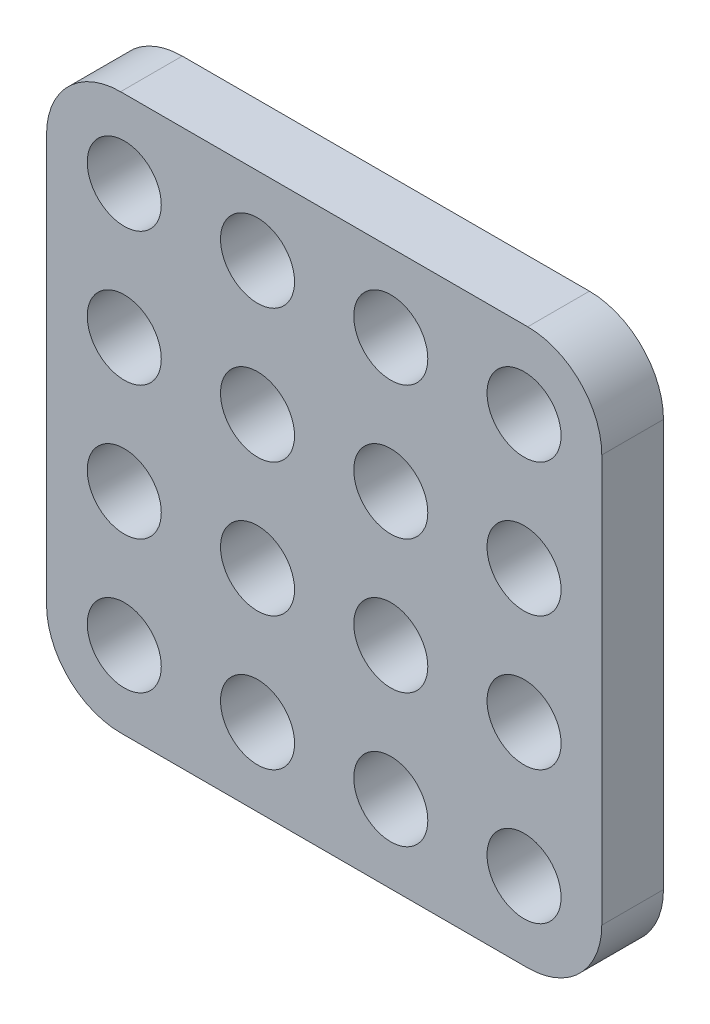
ISO-10303-21;
HEADER;
FILE_DESCRIPTION(('STEP AP214'),'2;1');
FILE_NAME('part.step','',(''),(''),'','','');
FILE_SCHEMA(('AUTOMOTIVE_DESIGN { 1 0 10303 214 1 1 1 1 }'));
ENDSEC;
DATA;
#1=APPLICATION_CONTEXT('core data for automotive mechanical design processes');
#2=APPLICATION_PROTOCOL_DEFINITION('international standard','automotive_design',2000,#1);
#3=PRODUCT_CONTEXT('',#1,'mechanical');
#4=PRODUCT('Part','Part','',(#3));
#5=PRODUCT_RELATED_PRODUCT_CATEGORY('part','',(#4));
#6=PRODUCT_DEFINITION_FORMATION('','',#4);
#7=PRODUCT_DEFINITION_CONTEXT('part definition',#1,'design');
#8=PRODUCT_DEFINITION('design','',#6,#7);
#9=PRODUCT_DEFINITION_SHAPE('','',#8);
#10=(LENGTH_UNIT() NAMED_UNIT(*) SI_UNIT(.MILLI.,.METRE.));
#11=(NAMED_UNIT(*) PLANE_ANGLE_UNIT() SI_UNIT($,.RADIAN.));
#12=(NAMED_UNIT(*) SI_UNIT($,.STERADIAN.) SOLID_ANGLE_UNIT());
#13=UNCERTAINTY_MEASURE_WITH_UNIT(LENGTH_MEASURE(1.E-05),#10,'distance_accuracy_value','');
#14=(GEOMETRIC_REPRESENTATION_CONTEXT(3) GLOBAL_UNCERTAINTY_ASSIGNED_CONTEXT((#13)) GLOBAL_UNIT_ASSIGNED_CONTEXT((#10,
#11,#12)) REPRESENTATION_CONTEXT('',''));
#15=CARTESIAN_POINT('',(0.,0.,0.));
#16=DIRECTION('',(0.,0.,1.));
#17=DIRECTION('',(1.,0.,0.));
#18=AXIS2_PLACEMENT_3D('',#15,#16,#17);
#19=CARTESIAN_POINT('',(93.2050056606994,230.510748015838,10.));
#20=DIRECTION('',(0.,0.,1.));
#21=DIRECTION('',(1.,0.,0.));
#22=AXIS2_PLACEMENT_3D('',#19,#20,#21);
#23=PLANE('',#22);
#24=CARTESIAN_POINT('',(49.4050056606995,186.710748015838,10.));
#25=DIRECTION('',(0.,0.,1.));
#26=DIRECTION('',(1.,0.,0.));
#27=AXIS2_PLACEMENT_3D('',#24,#25,#26);
#28=CIRCLE('',#27,5.99999999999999);
#29=CARTESIAN_POINT('',(55.4050056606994,186.710748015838,10.));
#30=VERTEX_POINT('',#29);
#31=EDGE_CURVE('E260',#30,#30,#28,.T.);
#32=ORIENTED_EDGE('',*,*,#31,.F.);
#33=EDGE_LOOP('',(#32));
#34=FACE_BOUND('',#33,.T.);
#35=CARTESIAN_POINT('',(49.4050056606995,208.310748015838,10.));
#36=DIRECTION('',(0.,0.,1.));
#37=DIRECTION('',(1.,0.,0.));
#38=AXIS2_PLACEMENT_3D('',#35,#36,#37);
#39=CIRCLE('',#38,5.99999999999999);
#40=CARTESIAN_POINT('',(55.4050056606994,208.310748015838,10.));
#41=VERTEX_POINT('',#40);
#42=EDGE_CURVE('E248',#41,#41,#39,.T.);
#43=ORIENTED_EDGE('',*,*,#42,.F.);
#44=EDGE_LOOP('',(#43));
#45=FACE_BOUND('',#44,.T.);
#46=CARTESIAN_POINT('',(49.4050056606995,165.110748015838,10.));
#47=DIRECTION('',(0.,0.,1.));
#48=DIRECTION('',(1.,0.,0.));
#49=AXIS2_PLACEMENT_3D('',#46,#47,#48);
#50=CIRCLE('',#49,5.99999999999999);
#51=CARTESIAN_POINT('',(55.4050056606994,165.110748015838,10.));
#52=VERTEX_POINT('',#51);
#53=EDGE_CURVE('E236',#52,#52,#50,.T.);
#54=ORIENTED_EDGE('',*,*,#53,.F.);
#55=EDGE_LOOP('',(#54));
#56=FACE_BOUND('',#55,.T.);
#57=CARTESIAN_POINT('',(71.0050056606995,165.110748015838,10.));
#58=DIRECTION('',(0.,0.,1.));
#59=DIRECTION('',(1.,0.,0.));
#60=AXIS2_PLACEMENT_3D('',#57,#58,#59);
#61=CIRCLE('',#60,6.00000000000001);
#62=CARTESIAN_POINT('',(77.0050056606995,165.110748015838,10.));
#63=VERTEX_POINT('',#62);
#64=EDGE_CURVE('E224',#63,#63,#61,.T.);
#65=ORIENTED_EDGE('',*,*,#64,.F.);
#66=EDGE_LOOP('',(#65));
#67=FACE_BOUND('',#66,.T.);
#68=CARTESIAN_POINT('',(27.8050056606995,229.910748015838,10.));
#69=DIRECTION('',(0.,0.,1.));
#70=DIRECTION('',(1.,0.,0.));
#71=AXIS2_PLACEMENT_3D('',#68,#69,#70);
#72=CIRCLE('',#71,6.);
#73=CARTESIAN_POINT('',(33.8050056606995,229.910748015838,10.));
#74=VERTEX_POINT('',#73);
#75=EDGE_CURVE('E212',#74,#74,#72,.T.);
#76=ORIENTED_EDGE('',*,*,#75,.F.);
#77=EDGE_LOOP('',(#76));
#78=FACE_BOUND('',#77,.T.);
#79=CARTESIAN_POINT('',(27.8050056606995,165.110748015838,10.));
#80=DIRECTION('',(0.,0.,1.));
#81=DIRECTION('',(1.,0.,0.));
#82=AXIS2_PLACEMENT_3D('',#79,#80,#81);
#83=CIRCLE('',#82,6.);
#84=CARTESIAN_POINT('',(33.8050056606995,165.110748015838,10.));
#85=VERTEX_POINT('',#84);
#86=EDGE_CURVE('E200',#85,#85,#83,.T.);
#87=ORIENTED_EDGE('',*,*,#86,.F.);
#88=EDGE_LOOP('',(#87));
#89=FACE_BOUND('',#88,.T.);
#90=CARTESIAN_POINT('',(92.6050056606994,208.310748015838,10.));
#91=DIRECTION('',(0.,0.,1.));
#92=DIRECTION('',(1.,0.,0.));
#93=AXIS2_PLACEMENT_3D('',#90,#91,#92);
#94=CIRCLE('',#93,6.00000000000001);
#95=CARTESIAN_POINT('',(98.6050056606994,208.310748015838,10.));
#96=VERTEX_POINT('',#95);
#97=EDGE_CURVE('E188',#96,#96,#94,.T.);
#98=ORIENTED_EDGE('',*,*,#97,.F.);
#99=EDGE_LOOP('',(#98));
#100=FACE_BOUND('',#99,.T.);
#101=CARTESIAN_POINT('',(71.0050056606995,208.310748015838,10.));
#102=DIRECTION('',(0.,0.,1.));
#103=DIRECTION('',(1.,0.,0.));
#104=AXIS2_PLACEMENT_3D('',#101,#102,#103);
#105=CIRCLE('',#104,6.00000000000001);
#106=CARTESIAN_POINT('',(77.0050056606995,208.310748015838,10.));
#107=VERTEX_POINT('',#106);
#108=EDGE_CURVE('E134',#107,#107,#105,.T.);
#109=ORIENTED_EDGE('',*,*,#108,.F.);
#110=EDGE_LOOP('',(#109));
#111=FACE_BOUND('',#110,.T.);
#112=CARTESIAN_POINT('',(93.2050056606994,230.510748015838,10.));
#113=DIRECTION('',(0.,0.,1.));
#114=DIRECTION('',(1.,0.,0.));
#115=AXIS2_PLACEMENT_3D('',#112,#113,#114);
#116=CIRCLE('',#115,12.);
#117=CARTESIAN_POINT('',(105.205005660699,230.510748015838,10.));
#118=VERTEX_POINT('',#117);
#119=CARTESIAN_POINT('',(93.2050056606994,242.510748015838,10.));
#120=VERTEX_POINT('',#119);
#121=EDGE_CURVE('E145',#118,#120,#116,.T.);
#122=ORIENTED_EDGE('',*,*,#121,.T.);
#123=DIRECTION('',(-1.,0.,0.));
#124=VECTOR('',#123,1.);
#125=CARTESIAN_POINT('',(27.2050056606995,242.510748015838,10.));
#126=LINE('',#125,#124);
#127=CARTESIAN_POINT('',(27.2050056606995,242.510748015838,10.));
#128=VERTEX_POINT('',#127);
#129=EDGE_CURVE('E93',#120,#128,#126,.T.);
#130=ORIENTED_EDGE('',*,*,#129,.T.);
#131=CARTESIAN_POINT('',(27.2050056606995,230.510748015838,10.));
#132=DIRECTION('',(0.,0.,1.));
#133=DIRECTION('',(1.,0.,0.));
#134=AXIS2_PLACEMENT_3D('',#131,#132,#133);
#135=CIRCLE('',#134,12.);
#136=CARTESIAN_POINT('',(15.2050056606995,230.510748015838,10.));
#137=VERTEX_POINT('',#136);
#138=EDGE_CURVE('E160',#128,#137,#135,.T.);
#139=ORIENTED_EDGE('',*,*,#138,.T.);
#140=DIRECTION('',(0.,-1.,0.));
#141=VECTOR('',#140,1.);
#142=CARTESIAN_POINT('',(15.2050056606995,230.510748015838,10.));
#143=LINE('',#142,#141);
#144=CARTESIAN_POINT('',(15.2050056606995,164.510748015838,10.));
#145=VERTEX_POINT('',#144);
#146=EDGE_CURVE('E173',#137,#145,#143,.T.);
#147=ORIENTED_EDGE('',*,*,#146,.T.);
#148=CARTESIAN_POINT('',(27.2050056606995,164.510748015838,10.));
#149=DIRECTION('',(0.,0.,1.));
#150=DIRECTION('',(1.,0.,0.));
#151=AXIS2_PLACEMENT_3D('',#148,#149,#150);
#152=CIRCLE('',#151,12.);
#153=CARTESIAN_POINT('',(27.2050056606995,152.510748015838,10.));
#154=VERTEX_POINT('',#153);
#155=EDGE_CURVE('E112',#145,#154,#152,.T.);
#156=ORIENTED_EDGE('',*,*,#155,.T.);
#157=DIRECTION('',(1.,0.,0.));
#158=VECTOR('',#157,1.);
#159=CARTESIAN_POINT('',(27.2050056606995,152.510748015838,10.));
#160=LINE('',#159,#158);
#161=CARTESIAN_POINT('',(93.2050056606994,152.510748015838,10.));
#162=VERTEX_POINT('',#161);
#163=EDGE_CURVE('E106',#154,#162,#160,.T.);
#164=ORIENTED_EDGE('',*,*,#163,.T.);
#165=CARTESIAN_POINT('',(93.2050056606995,164.510748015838,10.));
#166=DIRECTION('',(0.,0.,1.));
#167=DIRECTION('',(1.,0.,0.));
#168=AXIS2_PLACEMENT_3D('',#165,#166,#167);
#169=CIRCLE('',#168,12.);
#170=CARTESIAN_POINT('',(105.205005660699,164.510748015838,10.));
#171=VERTEX_POINT('',#170);
#172=EDGE_CURVE('E110',#162,#171,#169,.T.);
#173=ORIENTED_EDGE('',*,*,#172,.T.);
#174=DIRECTION('',(0.,1.,0.));
#175=VECTOR('',#174,1.);
#176=CARTESIAN_POINT('',(105.205005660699,230.510748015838,10.));
#177=LINE('',#176,#175);
#178=EDGE_CURVE('E50',#171,#118,#177,.T.);
#179=ORIENTED_EDGE('',*,*,#178,.T.);
#180=EDGE_LOOP('',(#122,#130,#139,#147,#156,#164,#173,#179));
#181=FACE_BOUND('',#180,.T.);
#182=CARTESIAN_POINT('',(92.6050056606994,229.910748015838,10.));
#183=DIRECTION('',(0.,0.,1.));
#184=DIRECTION('',(1.,0.,0.));
#185=AXIS2_PLACEMENT_3D('',#182,#183,#184);
#186=CIRCLE('',#185,6.00000000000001);
#187=CARTESIAN_POINT('',(98.6050056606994,229.910748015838,10.));
#188=VERTEX_POINT('',#187);
#189=EDGE_CURVE('E182',#188,#188,#186,.T.);
#190=ORIENTED_EDGE('',*,*,#189,.F.);
#191=EDGE_LOOP('',(#190));
#192=FACE_BOUND('',#191,.T.);
#193=CARTESIAN_POINT('',(71.0050056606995,186.710748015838,10.));
#194=DIRECTION('',(0.,0.,1.));
#195=DIRECTION('',(1.,0.,0.));
#196=AXIS2_PLACEMENT_3D('',#193,#194,#195);
#197=CIRCLE('',#196,6.00000000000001);
#198=CARTESIAN_POINT('',(77.0050056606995,186.710748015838,10.));
#199=VERTEX_POINT('',#198);
#200=EDGE_CURVE('E194',#199,#199,#197,.T.);
#201=ORIENTED_EDGE('',*,*,#200,.F.);
#202=EDGE_LOOP('',(#201));
#203=FACE_BOUND('',#202,.T.);
#204=CARTESIAN_POINT('',(92.6050056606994,186.710748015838,10.));
#205=DIRECTION('',(0.,0.,1.));
#206=DIRECTION('',(1.,0.,0.));
#207=AXIS2_PLACEMENT_3D('',#204,#205,#206);
#208=CIRCLE('',#207,6.00000000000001);
#209=CARTESIAN_POINT('',(98.6050056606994,186.710748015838,10.));
#210=VERTEX_POINT('',#209);
#211=EDGE_CURVE('E206',#210,#210,#208,.T.);
#212=ORIENTED_EDGE('',*,*,#211,.F.);
#213=EDGE_LOOP('',(#212));
#214=FACE_BOUND('',#213,.T.);
#215=CARTESIAN_POINT('',(27.8050056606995,186.710748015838,10.));
#216=DIRECTION('',(0.,0.,1.));
#217=DIRECTION('',(1.,0.,0.));
#218=AXIS2_PLACEMENT_3D('',#215,#216,#217);
#219=CIRCLE('',#218,6.);
#220=CARTESIAN_POINT('',(33.8050056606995,186.710748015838,10.));
#221=VERTEX_POINT('',#220);
#222=EDGE_CURVE('E218',#221,#221,#219,.T.);
#223=ORIENTED_EDGE('',*,*,#222,.F.);
#224=EDGE_LOOP('',(#223));
#225=FACE_BOUND('',#224,.T.);
#226=CARTESIAN_POINT('',(92.6050056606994,165.110748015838,10.));
#227=DIRECTION('',(0.,0.,1.));
#228=DIRECTION('',(1.,0.,0.));
#229=AXIS2_PLACEMENT_3D('',#226,#227,#228);
#230=CIRCLE('',#229,6.00000000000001);
#231=CARTESIAN_POINT('',(98.6050056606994,165.110748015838,10.));
#232=VERTEX_POINT('',#231);
#233=EDGE_CURVE('E230',#232,#232,#230,.T.);
#234=ORIENTED_EDGE('',*,*,#233,.F.);
#235=EDGE_LOOP('',(#234));
#236=FACE_BOUND('',#235,.T.);
#237=CARTESIAN_POINT('',(27.8050056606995,208.310748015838,10.));
#238=DIRECTION('',(0.,0.,1.));
#239=DIRECTION('',(1.,0.,0.));
#240=AXIS2_PLACEMENT_3D('',#237,#238,#239);
#241=CIRCLE('',#240,6.);
#242=CARTESIAN_POINT('',(33.8050056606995,208.310748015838,10.));
#243=VERTEX_POINT('',#242);
#244=EDGE_CURVE('E242',#243,#243,#241,.T.);
#245=ORIENTED_EDGE('',*,*,#244,.F.);
#246=EDGE_LOOP('',(#245));
#247=FACE_BOUND('',#246,.T.);
#248=CARTESIAN_POINT('',(49.4050056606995,229.910748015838,10.));
#249=DIRECTION('',(0.,0.,1.));
#250=DIRECTION('',(1.,0.,0.));
#251=AXIS2_PLACEMENT_3D('',#248,#249,#250);
#252=CIRCLE('',#251,5.99999999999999);
#253=CARTESIAN_POINT('',(55.4050056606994,229.910748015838,10.));
#254=VERTEX_POINT('',#253);
#255=EDGE_CURVE('E254',#254,#254,#252,.T.);
#256=ORIENTED_EDGE('',*,*,#255,.F.);
#257=EDGE_LOOP('',(#256));
#258=FACE_BOUND('',#257,.T.);
#259=CARTESIAN_POINT('',(71.0050056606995,229.910748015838,10.));
#260=DIRECTION('',(0.,0.,1.));
#261=DIRECTION('',(1.,0.,0.));
#262=AXIS2_PLACEMENT_3D('',#259,#260,#261);
#263=CIRCLE('',#262,6.00000000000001);
#264=CARTESIAN_POINT('',(77.0050056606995,229.910748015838,10.));
#265=VERTEX_POINT('',#264);
#266=EDGE_CURVE('E266',#265,#265,#263,.T.);
#267=ORIENTED_EDGE('',*,*,#266,.F.);
#268=EDGE_LOOP('',(#267));
#269=FACE_BOUND('',#268,.T.);
#270=ADVANCED_FACE('F33',(#34,#45,#56,#67,#78,#89,#100,#111,#181,#192,#203,#214,#225,#236,#247,
#258,#269),#23,.T.);
#271=CARTESIAN_POINT('',(93.2050056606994,230.510748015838,0.));
#272=DIRECTION('',(0.,0.,1.));
#273=DIRECTION('',(1.,0.,0.));
#274=AXIS2_PLACEMENT_3D('',#271,#272,#273);
#275=PLANE('',#274);
#276=CARTESIAN_POINT('',(49.4050056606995,186.710748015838,0.));
#277=DIRECTION('',(0.,0.,1.));
#278=DIRECTION('',(1.,0.,0.));
#279=AXIS2_PLACEMENT_3D('',#276,#277,#278);
#280=CIRCLE('',#279,5.99999999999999);
#281=CARTESIAN_POINT('',(55.4050056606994,186.710748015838,0.));
#282=VERTEX_POINT('',#281);
#283=EDGE_CURVE('E263',#282,#282,#280,.T.);
#284=ORIENTED_EDGE('',*,*,#283,.T.);
#285=EDGE_LOOP('',(#284));
#286=FACE_BOUND('',#285,.T.);
#287=CARTESIAN_POINT('',(49.4050056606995,208.310748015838,0.));
#288=DIRECTION('',(0.,0.,1.));
#289=DIRECTION('',(1.,0.,0.));
#290=AXIS2_PLACEMENT_3D('',#287,#288,#289);
#291=CIRCLE('',#290,5.99999999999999);
#292=CARTESIAN_POINT('',(55.4050056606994,208.310748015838,0.));
#293=VERTEX_POINT('',#292);
#294=EDGE_CURVE('E251',#293,#293,#291,.T.);
#295=ORIENTED_EDGE('',*,*,#294,.T.);
#296=EDGE_LOOP('',(#295));
#297=FACE_BOUND('',#296,.T.);
#298=CARTESIAN_POINT('',(49.4050056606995,165.110748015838,0.));
#299=DIRECTION('',(0.,0.,1.));
#300=DIRECTION('',(1.,0.,0.));
#301=AXIS2_PLACEMENT_3D('',#298,#299,#300);
#302=CIRCLE('',#301,5.99999999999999);
#303=CARTESIAN_POINT('',(55.4050056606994,165.110748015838,0.));
#304=VERTEX_POINT('',#303);
#305=EDGE_CURVE('E239',#304,#304,#302,.T.);
#306=ORIENTED_EDGE('',*,*,#305,.T.);
#307=EDGE_LOOP('',(#306));
#308=FACE_BOUND('',#307,.T.);
#309=CARTESIAN_POINT('',(71.0050056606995,165.110748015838,0.));
#310=DIRECTION('',(0.,0.,1.));
#311=DIRECTION('',(1.,0.,0.));
#312=AXIS2_PLACEMENT_3D('',#309,#310,#311);
#313=CIRCLE('',#312,6.00000000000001);
#314=CARTESIAN_POINT('',(77.0050056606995,165.110748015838,0.));
#315=VERTEX_POINT('',#314);
#316=EDGE_CURVE('E227',#315,#315,#313,.T.);
#317=ORIENTED_EDGE('',*,*,#316,.T.);
#318=EDGE_LOOP('',(#317));
#319=FACE_BOUND('',#318,.T.);
#320=CARTESIAN_POINT('',(27.8050056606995,229.910748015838,0.));
#321=DIRECTION('',(0.,0.,1.));
#322=DIRECTION('',(1.,0.,0.));
#323=AXIS2_PLACEMENT_3D('',#320,#321,#322);
#324=CIRCLE('',#323,6.);
#325=CARTESIAN_POINT('',(33.8050056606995,229.910748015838,0.));
#326=VERTEX_POINT('',#325);
#327=EDGE_CURVE('E215',#326,#326,#324,.T.);
#328=ORIENTED_EDGE('',*,*,#327,.T.);
#329=EDGE_LOOP('',(#328));
#330=FACE_BOUND('',#329,.T.);
#331=CARTESIAN_POINT('',(27.8050056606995,165.110748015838,0.));
#332=DIRECTION('',(0.,0.,1.));
#333=DIRECTION('',(1.,0.,0.));
#334=AXIS2_PLACEMENT_3D('',#331,#332,#333);
#335=CIRCLE('',#334,6.);
#336=CARTESIAN_POINT('',(33.8050056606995,165.110748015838,0.));
#337=VERTEX_POINT('',#336);
#338=EDGE_CURVE('E203',#337,#337,#335,.T.);
#339=ORIENTED_EDGE('',*,*,#338,.T.);
#340=EDGE_LOOP('',(#339));
#341=FACE_BOUND('',#340,.T.);
#342=CARTESIAN_POINT('',(92.6050056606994,208.310748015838,0.));
#343=DIRECTION('',(0.,0.,1.));
#344=DIRECTION('',(1.,0.,0.));
#345=AXIS2_PLACEMENT_3D('',#342,#343,#344);
#346=CIRCLE('',#345,6.00000000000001);
#347=CARTESIAN_POINT('',(98.6050056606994,208.310748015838,0.));
#348=VERTEX_POINT('',#347);
#349=EDGE_CURVE('E191',#348,#348,#346,.T.);
#350=ORIENTED_EDGE('',*,*,#349,.T.);
#351=EDGE_LOOP('',(#350));
#352=FACE_BOUND('',#351,.T.);
#353=CARTESIAN_POINT('',(71.0050056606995,208.310748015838,0.));
#354=DIRECTION('',(0.,0.,1.));
#355=DIRECTION('',(1.,0.,0.));
#356=AXIS2_PLACEMENT_3D('',#353,#354,#355);
#357=CIRCLE('',#356,6.00000000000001);
#358=CARTESIAN_POINT('',(77.0050056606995,208.310748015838,0.));
#359=VERTEX_POINT('',#358);
#360=EDGE_CURVE('E179',#359,#359,#357,.T.);
#361=ORIENTED_EDGE('',*,*,#360,.T.);
#362=EDGE_LOOP('',(#361));
#363=FACE_BOUND('',#362,.T.);
#364=CARTESIAN_POINT('',(93.2050056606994,230.510748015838,0.));
#365=DIRECTION('',(0.,0.,1.));
#366=DIRECTION('',(1.,0.,0.));
#367=AXIS2_PLACEMENT_3D('',#364,#365,#366);
#368=CIRCLE('',#367,12.);
#369=CARTESIAN_POINT('',(105.205005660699,230.510748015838,0.));
#370=VERTEX_POINT('',#369);
#371=CARTESIAN_POINT('',(93.2050056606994,242.510748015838,0.));
#372=VERTEX_POINT('',#371);
#373=EDGE_CURVE('E130',#370,#372,#368,.T.);
#374=ORIENTED_EDGE('',*,*,#373,.F.);
#375=DIRECTION('',(0.,1.,0.));
#376=VECTOR('',#375,1.);
#377=CARTESIAN_POINT('',(105.205005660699,230.510748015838,0.));
#378=LINE('',#377,#376);
#379=CARTESIAN_POINT('',(105.205005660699,164.510748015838,0.));
#380=VERTEX_POINT('',#379);
#381=EDGE_CURVE('E85',#380,#370,#378,.T.);
#382=ORIENTED_EDGE('',*,*,#381,.F.);
#383=CARTESIAN_POINT('',(93.2050056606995,164.510748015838,0.));
#384=DIRECTION('',(0.,0.,1.));
#385=DIRECTION('',(1.,0.,0.));
#386=AXIS2_PLACEMENT_3D('',#383,#384,#385);
#387=CIRCLE('',#386,12.);
#388=CARTESIAN_POINT('',(93.2050056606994,152.510748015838,0.));
#389=VERTEX_POINT('',#388);
#390=EDGE_CURVE('E79',#389,#380,#387,.T.);
#391=ORIENTED_EDGE('',*,*,#390,.F.);
#392=DIRECTION('',(1.,0.,0.));
#393=VECTOR('',#392,1.);
#394=CARTESIAN_POINT('',(27.2050056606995,152.510748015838,0.));
#395=LINE('',#394,#393);
#396=CARTESIAN_POINT('',(27.2050056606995,152.510748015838,0.));
#397=VERTEX_POINT('',#396);
#398=EDGE_CURVE('E120',#397,#389,#395,.T.);
#399=ORIENTED_EDGE('',*,*,#398,.F.);
#400=CARTESIAN_POINT('',(27.2050056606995,164.510748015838,0.));
#401=DIRECTION('',(0.,0.,1.));
#402=DIRECTION('',(1.,0.,0.));
#403=AXIS2_PLACEMENT_3D('',#400,#401,#402);
#404=CIRCLE('',#403,12.);
#405=CARTESIAN_POINT('',(15.2050056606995,164.510748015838,0.));
#406=VERTEX_POINT('',#405);
#407=EDGE_CURVE('E140',#406,#397,#404,.T.);
#408=ORIENTED_EDGE('',*,*,#407,.F.);
#409=DIRECTION('',(0.,-1.,0.));
#410=VECTOR('',#409,1.);
#411=CARTESIAN_POINT('',(15.2050056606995,230.510748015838,0.));
#412=LINE('',#411,#410);
#413=CARTESIAN_POINT('',(15.2050056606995,230.510748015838,0.));
#414=VERTEX_POINT('',#413);
#415=EDGE_CURVE('E138',#414,#406,#412,.T.);
#416=ORIENTED_EDGE('',*,*,#415,.F.);
#417=CARTESIAN_POINT('',(27.2050056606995,230.510748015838,0.));
#418=DIRECTION('',(0.,0.,1.));
#419=DIRECTION('',(1.,0.,0.));
#420=AXIS2_PLACEMENT_3D('',#417,#418,#419);
#421=CIRCLE('',#420,12.);
#422=CARTESIAN_POINT('',(27.2050056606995,242.510748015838,0.));
#423=VERTEX_POINT('',#422);
#424=EDGE_CURVE('E136',#423,#414,#421,.T.);
#425=ORIENTED_EDGE('',*,*,#424,.F.);
#426=DIRECTION('',(-1.,0.,0.));
#427=VECTOR('',#426,1.);
#428=CARTESIAN_POINT('',(27.2050056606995,242.510748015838,0.));
#429=LINE('',#428,#427);
#430=EDGE_CURVE('E133',#372,#423,#429,.T.);
#431=ORIENTED_EDGE('',*,*,#430,.F.);
#432=EDGE_LOOP('',(#374,#382,#391,#399,#408,#416,#425,#431));
#433=FACE_BOUND('',#432,.T.);
#434=CARTESIAN_POINT('',(92.6050056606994,229.910748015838,0.));
#435=DIRECTION('',(0.,0.,1.));
#436=DIRECTION('',(1.,0.,0.));
#437=AXIS2_PLACEMENT_3D('',#434,#435,#436);
#438=CIRCLE('',#437,6.00000000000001);
#439=CARTESIAN_POINT('',(98.6050056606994,229.910748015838,0.));
#440=VERTEX_POINT('',#439);
#441=EDGE_CURVE('E185',#440,#440,#438,.T.);
#442=ORIENTED_EDGE('',*,*,#441,.T.);
#443=EDGE_LOOP('',(#442));
#444=FACE_BOUND('',#443,.T.);
#445=CARTESIAN_POINT('',(71.0050056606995,186.710748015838,0.));
#446=DIRECTION('',(0.,0.,1.));
#447=DIRECTION('',(1.,0.,0.));
#448=AXIS2_PLACEMENT_3D('',#445,#446,#447);
#449=CIRCLE('',#448,6.00000000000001);
#450=CARTESIAN_POINT('',(77.0050056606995,186.710748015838,0.));
#451=VERTEX_POINT('',#450);
#452=EDGE_CURVE('E197',#451,#451,#449,.T.);
#453=ORIENTED_EDGE('',*,*,#452,.T.);
#454=EDGE_LOOP('',(#453));
#455=FACE_BOUND('',#454,.T.);
#456=CARTESIAN_POINT('',(92.6050056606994,186.710748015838,0.));
#457=DIRECTION('',(0.,0.,1.));
#458=DIRECTION('',(1.,0.,0.));
#459=AXIS2_PLACEMENT_3D('',#456,#457,#458);
#460=CIRCLE('',#459,6.00000000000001);
#461=CARTESIAN_POINT('',(98.6050056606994,186.710748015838,0.));
#462=VERTEX_POINT('',#461);
#463=EDGE_CURVE('E209',#462,#462,#460,.T.);
#464=ORIENTED_EDGE('',*,*,#463,.T.);
#465=EDGE_LOOP('',(#464));
#466=FACE_BOUND('',#465,.T.);
#467=CARTESIAN_POINT('',(27.8050056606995,186.710748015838,0.));
#468=DIRECTION('',(0.,0.,1.));
#469=DIRECTION('',(1.,0.,0.));
#470=AXIS2_PLACEMENT_3D('',#467,#468,#469);
#471=CIRCLE('',#470,6.);
#472=CARTESIAN_POINT('',(33.8050056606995,186.710748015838,0.));
#473=VERTEX_POINT('',#472);
#474=EDGE_CURVE('E221',#473,#473,#471,.T.);
#475=ORIENTED_EDGE('',*,*,#474,.T.);
#476=EDGE_LOOP('',(#475));
#477=FACE_BOUND('',#476,.T.);
#478=CARTESIAN_POINT('',(92.6050056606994,165.110748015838,0.));
#479=DIRECTION('',(0.,0.,1.));
#480=DIRECTION('',(1.,0.,0.));
#481=AXIS2_PLACEMENT_3D('',#478,#479,#480);
#482=CIRCLE('',#481,6.00000000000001);
#483=CARTESIAN_POINT('',(98.6050056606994,165.110748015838,0.));
#484=VERTEX_POINT('',#483);
#485=EDGE_CURVE('E233',#484,#484,#482,.T.);
#486=ORIENTED_EDGE('',*,*,#485,.T.);
#487=EDGE_LOOP('',(#486));
#488=FACE_BOUND('',#487,.T.);
#489=CARTESIAN_POINT('',(27.8050056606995,208.310748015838,0.));
#490=DIRECTION('',(0.,0.,1.));
#491=DIRECTION('',(1.,0.,0.));
#492=AXIS2_PLACEMENT_3D('',#489,#490,#491);
#493=CIRCLE('',#492,6.);
#494=CARTESIAN_POINT('',(33.8050056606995,208.310748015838,0.));
#495=VERTEX_POINT('',#494);
#496=EDGE_CURVE('E245',#495,#495,#493,.T.);
#497=ORIENTED_EDGE('',*,*,#496,.T.);
#498=EDGE_LOOP('',(#497));
#499=FACE_BOUND('',#498,.T.);
#500=CARTESIAN_POINT('',(49.4050056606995,229.910748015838,0.));
#501=DIRECTION('',(0.,0.,1.));
#502=DIRECTION('',(1.,0.,0.));
#503=AXIS2_PLACEMENT_3D('',#500,#501,#502);
#504=CIRCLE('',#503,5.99999999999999);
#505=CARTESIAN_POINT('',(55.4050056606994,229.910748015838,0.));
#506=VERTEX_POINT('',#505);
#507=EDGE_CURVE('E257',#506,#506,#504,.T.);
#508=ORIENTED_EDGE('',*,*,#507,.T.);
#509=EDGE_LOOP('',(#508));
#510=FACE_BOUND('',#509,.T.);
#511=CARTESIAN_POINT('',(71.0050056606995,229.910748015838,0.));
#512=DIRECTION('',(0.,0.,1.));
#513=DIRECTION('',(1.,0.,0.));
#514=AXIS2_PLACEMENT_3D('',#511,#512,#513);
#515=CIRCLE('',#514,6.00000000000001);
#516=CARTESIAN_POINT('',(77.0050056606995,229.910748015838,0.));
#517=VERTEX_POINT('',#516);
#518=EDGE_CURVE('E269',#517,#517,#515,.T.);
#519=ORIENTED_EDGE('',*,*,#518,.T.);
#520=EDGE_LOOP('',(#519));
#521=FACE_BOUND('',#520,.T.);
#522=ADVANCED_FACE('F164',(#286,#297,#308,#319,#330,#341,#352,#363,#433,#444,#455,#466,#477,
#488,#499,#510,#521),#275,.F.);
#523=CARTESIAN_POINT('',(93.2050056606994,230.510748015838,10.));
#524=DIRECTION('',(0.,0.,-1.));
#525=DIRECTION('',(-1.,0.,0.));
#526=AXIS2_PLACEMENT_3D('',#523,#524,#525);
#527=CYLINDRICAL_SURFACE('',#526,12.);
#528=ORIENTED_EDGE('',*,*,#373,.T.);
#529=DIRECTION('',(0.,0.,-1.));
#530=VECTOR('',#529,1.);
#531=CARTESIAN_POINT('',(93.2050056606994,242.510748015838,10.));
#532=LINE('',#531,#530);
#533=EDGE_CURVE('E11',#120,#372,#532,.T.);
#534=ORIENTED_EDGE('',*,*,#533,.F.);
#535=ORIENTED_EDGE('',*,*,#121,.F.);
#536=DIRECTION('',(0.,0.,-1.));
#537=VECTOR('',#536,1.);
#538=CARTESIAN_POINT('',(105.205005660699,230.510748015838,10.));
#539=LINE('',#538,#537);
#540=EDGE_CURVE('E126',#118,#370,#539,.T.);
#541=ORIENTED_EDGE('',*,*,#540,.T.);
#542=EDGE_LOOP('',(#528,#534,#535,#541));
#543=FACE_BOUND('',#542,.T.);
#544=ADVANCED_FACE('F35',(#543),#527,.T.);
#545=CARTESIAN_POINT('',(27.2050056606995,242.510748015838,10.));
#546=DIRECTION('',(0.,-1.,0.));
#547=DIRECTION('',(0.,0.,-1.));
#548=AXIS2_PLACEMENT_3D('',#545,#546,#547);
#549=PLANE('',#548);
#550=ORIENTED_EDGE('',*,*,#430,.T.);
#551=DIRECTION('',(0.,0.,-1.));
#552=VECTOR('',#551,1.);
#553=CARTESIAN_POINT('',(27.2050056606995,242.510748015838,10.));
#554=LINE('',#553,#552);
#555=EDGE_CURVE('E42',#128,#423,#554,.T.);
#556=ORIENTED_EDGE('',*,*,#555,.F.);
#557=ORIENTED_EDGE('',*,*,#129,.F.);
#558=ORIENTED_EDGE('',*,*,#533,.T.);
#559=EDGE_LOOP('',(#550,#556,#557,#558));
#560=FACE_BOUND('',#559,.T.);
#561=ADVANCED_FACE('F304',(#560),#549,.F.);
#562=CARTESIAN_POINT('',(27.2050056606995,230.510748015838,10.));
#563=DIRECTION('',(0.,0.,-1.));
#564=DIRECTION('',(-1.,0.,0.));
#565=AXIS2_PLACEMENT_3D('',#562,#563,#564);
#566=CYLINDRICAL_SURFACE('',#565,12.);
#567=ORIENTED_EDGE('',*,*,#424,.T.);
#568=DIRECTION('',(0.,0.,-1.));
#569=VECTOR('',#568,1.);
#570=CARTESIAN_POINT('',(15.2050056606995,230.510748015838,10.));
#571=LINE('',#570,#569);
#572=EDGE_CURVE('E152',#137,#414,#571,.T.);
#573=ORIENTED_EDGE('',*,*,#572,.F.);
#574=ORIENTED_EDGE('',*,*,#138,.F.);
#575=ORIENTED_EDGE('',*,*,#555,.T.);
#576=EDGE_LOOP('',(#567,#573,#574,#575));
#577=FACE_BOUND('',#576,.T.);
#578=ADVANCED_FACE('F158',(#577),#566,.T.);
#579=CARTESIAN_POINT('',(15.2050056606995,230.510748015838,10.));
#580=DIRECTION('',(1.,0.,0.));
#581=DIRECTION('',(0.,0.,-1.));
#582=AXIS2_PLACEMENT_3D('',#579,#580,#581);
#583=PLANE('',#582);
#584=ORIENTED_EDGE('',*,*,#415,.T.);
#585=DIRECTION('',(0.,0.,-1.));
#586=VECTOR('',#585,1.);
#587=CARTESIAN_POINT('',(15.2050056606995,164.510748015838,10.));
#588=LINE('',#587,#586);
#589=EDGE_CURVE('E149',#145,#406,#588,.T.);
#590=ORIENTED_EDGE('',*,*,#589,.F.);
#591=ORIENTED_EDGE('',*,*,#146,.F.);
#592=ORIENTED_EDGE('',*,*,#572,.T.);
#593=EDGE_LOOP('',(#584,#590,#591,#592));
#594=FACE_BOUND('',#593,.T.);
#595=ADVANCED_FACE('F169',(#594),#583,.F.);
#596=CARTESIAN_POINT('',(27.2050056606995,164.510748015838,10.));
#597=DIRECTION('',(0.,0.,-1.));
#598=DIRECTION('',(-1.,0.,0.));
#599=AXIS2_PLACEMENT_3D('',#596,#597,#598);
#600=CYLINDRICAL_SURFACE('',#599,12.);
#601=ORIENTED_EDGE('',*,*,#407,.T.);
#602=DIRECTION('',(0.,0.,-1.));
#603=VECTOR('',#602,1.);
#604=CARTESIAN_POINT('',(27.2050056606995,152.510748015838,10.));
#605=LINE('',#604,#603);
#606=EDGE_CURVE('E121',#154,#397,#605,.T.);
#607=ORIENTED_EDGE('',*,*,#606,.F.);
#608=ORIENTED_EDGE('',*,*,#155,.F.);
#609=ORIENTED_EDGE('',*,*,#589,.T.);
#610=EDGE_LOOP('',(#601,#607,#608,#609));
#611=FACE_BOUND('',#610,.T.);
#612=ADVANCED_FACE('F172',(#611),#600,.T.);
#613=CARTESIAN_POINT('',(27.2050056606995,152.510748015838,10.));
#614=DIRECTION('',(0.,1.,0.));
#615=DIRECTION('',(0.,0.,1.));
#616=AXIS2_PLACEMENT_3D('',#613,#614,#615);
#617=PLANE('',#616);
#618=ORIENTED_EDGE('',*,*,#398,.T.);
#619=DIRECTION('',(0.,0.,-1.));
#620=VECTOR('',#619,1.);
#621=CARTESIAN_POINT('',(93.2050056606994,152.510748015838,10.));
#622=LINE('',#621,#620);
#623=EDGE_CURVE('E117',#162,#389,#622,.T.);
#624=ORIENTED_EDGE('',*,*,#623,.F.);
#625=ORIENTED_EDGE('',*,*,#163,.F.);
#626=ORIENTED_EDGE('',*,*,#606,.T.);
#627=EDGE_LOOP('',(#618,#624,#625,#626));
#628=FACE_BOUND('',#627,.T.);
#629=ADVANCED_FACE('F118',(#628),#617,.F.);
#630=CARTESIAN_POINT('',(93.2050056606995,164.510748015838,10.));
#631=DIRECTION('',(0.,0.,-1.));
#632=DIRECTION('',(-1.,0.,0.));
#633=AXIS2_PLACEMENT_3D('',#630,#631,#632);
#634=CYLINDRICAL_SURFACE('',#633,12.);
#635=ORIENTED_EDGE('',*,*,#390,.T.);
#636=DIRECTION('',(0.,0.,-1.));
#637=VECTOR('',#636,1.);
#638=CARTESIAN_POINT('',(105.205005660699,164.510748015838,10.));
#639=LINE('',#638,#637);
#640=EDGE_CURVE('E122',#171,#380,#639,.T.);
#641=ORIENTED_EDGE('',*,*,#640,.F.);
#642=ORIENTED_EDGE('',*,*,#172,.F.);
#643=ORIENTED_EDGE('',*,*,#623,.T.);
#644=EDGE_LOOP('',(#635,#641,#642,#643));
#645=FACE_BOUND('',#644,.T.);
#646=ADVANCED_FACE('F124',(#645),#634,.T.);
#647=CARTESIAN_POINT('',(105.205005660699,230.510748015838,10.));
#648=DIRECTION('',(-1.,0.,0.));
#649=DIRECTION('',(0.,0.,1.));
#650=AXIS2_PLACEMENT_3D('',#647,#648,#649);
#651=PLANE('',#650);
#652=ORIENTED_EDGE('',*,*,#381,.T.);
#653=ORIENTED_EDGE('',*,*,#540,.F.);
#654=ORIENTED_EDGE('',*,*,#178,.F.);
#655=ORIENTED_EDGE('',*,*,#640,.T.);
#656=EDGE_LOOP('',(#652,#653,#654,#655));
#657=FACE_BOUND('',#656,.T.);
#658=ADVANCED_FACE('F292',(#657),#651,.F.);
#659=CARTESIAN_POINT('',(71.0050056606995,208.310748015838,10.));
#660=DIRECTION('',(0.,0.,-1.));
#661=DIRECTION('',(-1.,0.,0.));
#662=AXIS2_PLACEMENT_3D('',#659,#660,#661);
#663=CYLINDRICAL_SURFACE('',#662,6.00000000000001);
#664=ORIENTED_EDGE('',*,*,#108,.T.);
#665=EDGE_LOOP('',(#664));
#666=FACE_BOUND('',#665,.T.);
#667=ORIENTED_EDGE('',*,*,#360,.F.);
#668=EDGE_LOOP('',(#667));
#669=FACE_BOUND('',#668,.T.);
#670=ADVANCED_FACE('F289',(#666,#669),#663,.F.);
#671=CARTESIAN_POINT('',(92.6050056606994,229.910748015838,10.));
#672=DIRECTION('',(0.,0.,-1.));
#673=DIRECTION('',(-1.,0.,0.));
#674=AXIS2_PLACEMENT_3D('',#671,#672,#673);
#675=CYLINDRICAL_SURFACE('',#674,6.00000000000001);
#676=ORIENTED_EDGE('',*,*,#189,.T.);
#677=EDGE_LOOP('',(#676));
#678=FACE_BOUND('',#677,.T.);
#679=ORIENTED_EDGE('',*,*,#441,.F.);
#680=EDGE_LOOP('',(#679));
#681=FACE_BOUND('',#680,.T.);
#682=ADVANCED_FACE('F368',(#678,#681),#675,.F.);
#683=CARTESIAN_POINT('',(92.6050056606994,208.310748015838,10.));
#684=DIRECTION('',(0.,0.,-1.));
#685=DIRECTION('',(-1.,0.,0.));
#686=AXIS2_PLACEMENT_3D('',#683,#684,#685);
#687=CYLINDRICAL_SURFACE('',#686,6.00000000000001);
#688=ORIENTED_EDGE('',*,*,#97,.T.);
#689=EDGE_LOOP('',(#688));
#690=FACE_BOUND('',#689,.T.);
#691=ORIENTED_EDGE('',*,*,#349,.F.);
#692=EDGE_LOOP('',(#691));
#693=FACE_BOUND('',#692,.T.);
#694=ADVANCED_FACE('F376',(#690,#693),#687,.F.);
#695=CARTESIAN_POINT('',(71.0050056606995,186.710748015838,10.));
#696=DIRECTION('',(0.,0.,-1.));
#697=DIRECTION('',(-1.,0.,0.));
#698=AXIS2_PLACEMENT_3D('',#695,#696,#697);
#699=CYLINDRICAL_SURFACE('',#698,6.00000000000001);
#700=ORIENTED_EDGE('',*,*,#200,.T.);
#701=EDGE_LOOP('',(#700));
#702=FACE_BOUND('',#701,.T.);
#703=ORIENTED_EDGE('',*,*,#452,.F.);
#704=EDGE_LOOP('',(#703));
#705=FACE_BOUND('',#704,.T.);
#706=ADVANCED_FACE('F384',(#702,#705),#699,.F.);
#707=CARTESIAN_POINT('',(27.8050056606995,165.110748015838,10.));
#708=DIRECTION('',(0.,0.,-1.));
#709=DIRECTION('',(-1.,0.,0.));
#710=AXIS2_PLACEMENT_3D('',#707,#708,#709);
#711=CYLINDRICAL_SURFACE('',#710,6.);
#712=ORIENTED_EDGE('',*,*,#86,.T.);
#713=EDGE_LOOP('',(#712));
#714=FACE_BOUND('',#713,.T.);
#715=ORIENTED_EDGE('',*,*,#338,.F.);
#716=EDGE_LOOP('',(#715));
#717=FACE_BOUND('',#716,.T.);
#718=ADVANCED_FACE('F393',(#714,#717),#711,.F.);
#719=CARTESIAN_POINT('',(92.6050056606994,186.710748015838,10.));
#720=DIRECTION('',(0.,0.,-1.));
#721=DIRECTION('',(-1.,0.,0.));
#722=AXIS2_PLACEMENT_3D('',#719,#720,#721);
#723=CYLINDRICAL_SURFACE('',#722,6.00000000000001);
#724=ORIENTED_EDGE('',*,*,#211,.T.);
#725=EDGE_LOOP('',(#724));
#726=FACE_BOUND('',#725,.T.);
#727=ORIENTED_EDGE('',*,*,#463,.F.);
#728=EDGE_LOOP('',(#727));
#729=FACE_BOUND('',#728,.T.);
#730=ADVANCED_FACE('F402',(#726,#729),#723,.F.);
#731=CARTESIAN_POINT('',(27.8050056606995,229.910748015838,10.));
#732=DIRECTION('',(0.,0.,-1.));
#733=DIRECTION('',(-1.,0.,0.));
#734=AXIS2_PLACEMENT_3D('',#731,#732,#733);
#735=CYLINDRICAL_SURFACE('',#734,6.);
#736=ORIENTED_EDGE('',*,*,#75,.T.);
#737=EDGE_LOOP('',(#736));
#738=FACE_BOUND('',#737,.T.);
#739=ORIENTED_EDGE('',*,*,#327,.F.);
#740=EDGE_LOOP('',(#739));
#741=FACE_BOUND('',#740,.T.);
#742=ADVANCED_FACE('F411',(#738,#741),#735,.F.);
#743=CARTESIAN_POINT('',(27.8050056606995,186.710748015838,10.));
#744=DIRECTION('',(0.,0.,-1.));
#745=DIRECTION('',(-1.,0.,0.));
#746=AXIS2_PLACEMENT_3D('',#743,#744,#745);
#747=CYLINDRICAL_SURFACE('',#746,6.);
#748=ORIENTED_EDGE('',*,*,#222,.T.);
#749=EDGE_LOOP('',(#748));
#750=FACE_BOUND('',#749,.T.);
#751=ORIENTED_EDGE('',*,*,#474,.F.);
#752=EDGE_LOOP('',(#751));
#753=FACE_BOUND('',#752,.T.);
#754=ADVANCED_FACE('F420',(#750,#753),#747,.F.);
#755=CARTESIAN_POINT('',(71.0050056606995,165.110748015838,10.));
#756=DIRECTION('',(0.,0.,-1.));
#757=DIRECTION('',(-1.,0.,0.));
#758=AXIS2_PLACEMENT_3D('',#755,#756,#757);
#759=CYLINDRICAL_SURFACE('',#758,6.00000000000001);
#760=ORIENTED_EDGE('',*,*,#64,.T.);
#761=EDGE_LOOP('',(#760));
#762=FACE_BOUND('',#761,.T.);
#763=ORIENTED_EDGE('',*,*,#316,.F.);
#764=EDGE_LOOP('',(#763));
#765=FACE_BOUND('',#764,.T.);
#766=ADVANCED_FACE('F429',(#762,#765),#759,.F.);
#767=CARTESIAN_POINT('',(92.6050056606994,165.110748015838,10.));
#768=DIRECTION('',(0.,0.,-1.));
#769=DIRECTION('',(-1.,0.,0.));
#770=AXIS2_PLACEMENT_3D('',#767,#768,#769);
#771=CYLINDRICAL_SURFACE('',#770,6.00000000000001);
#772=ORIENTED_EDGE('',*,*,#233,.T.);
#773=EDGE_LOOP('',(#772));
#774=FACE_BOUND('',#773,.T.);
#775=ORIENTED_EDGE('',*,*,#485,.F.);
#776=EDGE_LOOP('',(#775));
#777=FACE_BOUND('',#776,.T.);
#778=ADVANCED_FACE('F438',(#774,#777),#771,.F.);
#779=CARTESIAN_POINT('',(49.4050056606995,165.110748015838,10.));
#780=DIRECTION('',(0.,0.,-1.));
#781=DIRECTION('',(-1.,0.,0.));
#782=AXIS2_PLACEMENT_3D('',#779,#780,#781);
#783=CYLINDRICAL_SURFACE('',#782,5.99999999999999);
#784=ORIENTED_EDGE('',*,*,#53,.T.);
#785=EDGE_LOOP('',(#784));
#786=FACE_BOUND('',#785,.T.);
#787=ORIENTED_EDGE('',*,*,#305,.F.);
#788=EDGE_LOOP('',(#787));
#789=FACE_BOUND('',#788,.T.);
#790=ADVANCED_FACE('F447',(#786,#789),#783,.F.);
#791=CARTESIAN_POINT('',(27.8050056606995,208.310748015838,10.));
#792=DIRECTION('',(0.,0.,-1.));
#793=DIRECTION('',(-1.,0.,0.));
#794=AXIS2_PLACEMENT_3D('',#791,#792,#793);
#795=CYLINDRICAL_SURFACE('',#794,6.);
#796=ORIENTED_EDGE('',*,*,#244,.T.);
#797=EDGE_LOOP('',(#796));
#798=FACE_BOUND('',#797,.T.);
#799=ORIENTED_EDGE('',*,*,#496,.F.);
#800=EDGE_LOOP('',(#799));
#801=FACE_BOUND('',#800,.T.);
#802=ADVANCED_FACE('F456',(#798,#801),#795,.F.);
#803=CARTESIAN_POINT('',(49.4050056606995,208.310748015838,10.));
#804=DIRECTION('',(0.,0.,-1.));
#805=DIRECTION('',(-1.,0.,0.));
#806=AXIS2_PLACEMENT_3D('',#803,#804,#805);
#807=CYLINDRICAL_SURFACE('',#806,5.99999999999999);
#808=ORIENTED_EDGE('',*,*,#42,.T.);
#809=EDGE_LOOP('',(#808));
#810=FACE_BOUND('',#809,.T.);
#811=ORIENTED_EDGE('',*,*,#294,.F.);
#812=EDGE_LOOP('',(#811));
#813=FACE_BOUND('',#812,.T.);
#814=ADVANCED_FACE('F465',(#810,#813),#807,.F.);
#815=CARTESIAN_POINT('',(49.4050056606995,229.910748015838,10.));
#816=DIRECTION('',(0.,0.,-1.));
#817=DIRECTION('',(-1.,0.,0.));
#818=AXIS2_PLACEMENT_3D('',#815,#816,#817);
#819=CYLINDRICAL_SURFACE('',#818,5.99999999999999);
#820=ORIENTED_EDGE('',*,*,#255,.T.);
#821=EDGE_LOOP('',(#820));
#822=FACE_BOUND('',#821,.T.);
#823=ORIENTED_EDGE('',*,*,#507,.F.);
#824=EDGE_LOOP('',(#823));
#825=FACE_BOUND('',#824,.T.);
#826=ADVANCED_FACE('F474',(#822,#825),#819,.F.);
#827=CARTESIAN_POINT('',(49.4050056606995,186.710748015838,10.));
#828=DIRECTION('',(0.,0.,-1.));
#829=DIRECTION('',(-1.,0.,0.));
#830=AXIS2_PLACEMENT_3D('',#827,#828,#829);
#831=CYLINDRICAL_SURFACE('',#830,5.99999999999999);
#832=ORIENTED_EDGE('',*,*,#31,.T.);
#833=EDGE_LOOP('',(#832));
#834=FACE_BOUND('',#833,.T.);
#835=ORIENTED_EDGE('',*,*,#283,.F.);
#836=EDGE_LOOP('',(#835));
#837=FACE_BOUND('',#836,.T.);
#838=ADVANCED_FACE('F483',(#834,#837),#831,.F.);
#839=CARTESIAN_POINT('',(71.0050056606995,229.910748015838,10.));
#840=DIRECTION('',(0.,0.,-1.));
#841=DIRECTION('',(-1.,0.,0.));
#842=AXIS2_PLACEMENT_3D('',#839,#840,#841);
#843=CYLINDRICAL_SURFACE('',#842,6.00000000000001);
#844=ORIENTED_EDGE('',*,*,#266,.T.);
#845=EDGE_LOOP('',(#844));
#846=FACE_BOUND('',#845,.T.);
#847=ORIENTED_EDGE('',*,*,#518,.F.);
#848=EDGE_LOOP('',(#847));
#849=FACE_BOUND('',#848,.T.);
#850=ADVANCED_FACE('F275',(#846,#849),#843,.F.);
#851=CLOSED_SHELL('',(#270,#522,#544,#561,#578,#595,#612,#629,#646,#658,#670,#682,#694,#706,
#718,#730,#742,#754,#766,#778,#790,#802,#814,#826,#838,#850));
#852=MANIFOLD_SOLID_BREP('B2',#851);
#853=ADVANCED_BREP_SHAPE_REPRESENTATION('',(#18,#852),#14);
#854=SHAPE_DEFINITION_REPRESENTATION(#9,#853);
ENDSEC;
END-ISO-10303-21;
